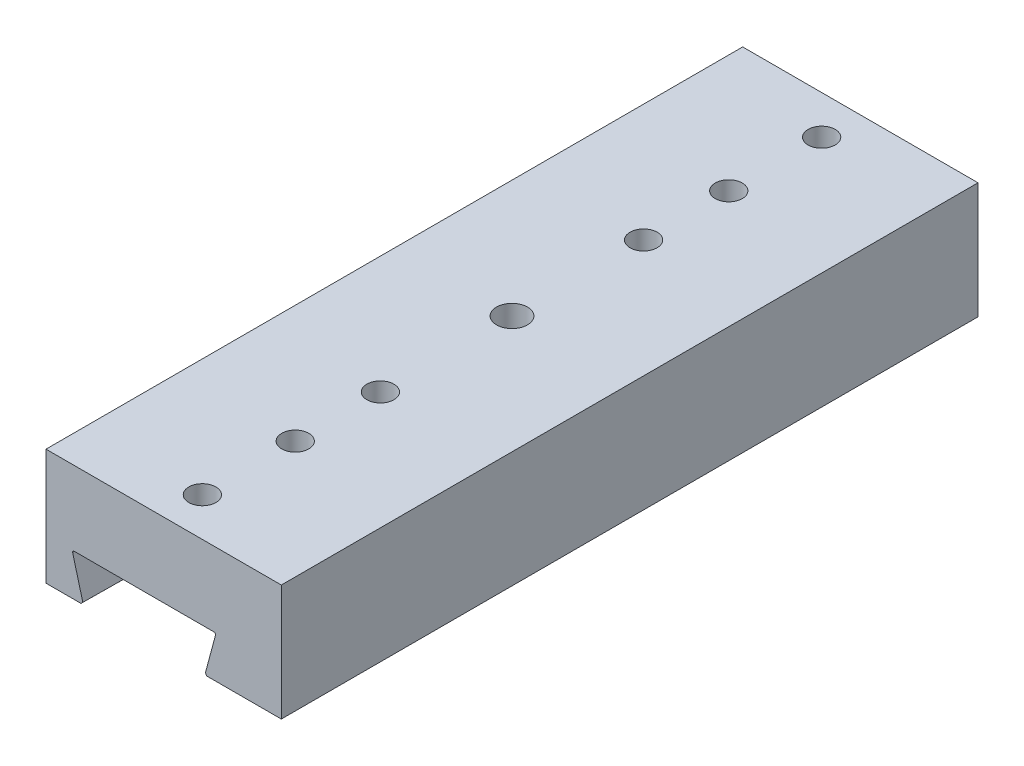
from build123d import *
from OCP.BRepFilletAPI import BRepFilletAPI_MakeChamfer

# Parameters (mm, degrees)
ESQUISSE1_W                                        = 152
ESQUISSE1_H                                        = 75
BOSS_EXTRU_1_DEPTH                                 = 225
CHAMBRAGE_POUR_VIS_T_TE_HEXAGONALE_M16_D           = 17.5
CHAMBRAGE_POUR_VIS_T_TE_HEXAGONALE_M16_CBORE_D     = 30
CHAMBRAGE_POUR_VIS_T_TE_HEXAGONALE_M16_CBORE_DEPTH = 20.6
ENL_V_MAT_EXTRU_1_REACH                            = 244.291
ESQUISSE6_R                                        = 10
CONG_1_R                                           = 1
CHANFREIN1_SIZE                                    = 1.5
CHANFREIN1_SIZE2                                   = 1.22475371
CHANFREIN1_SIZE2_2                                 = 1.224744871
CHANFREIN2_SIZE                                    = 1


with BuildPart() as part:
    # Esquisse1 → Boss.-Extru.1 (new, symmetric)
    with BuildSketch(Plane.XY):
        with Locations((0, -37.5)):
            Rectangle(ESQUISSE1_W, ESQUISSE1_H)
    extrude(amount=BOSS_EXTRU_1_DEPTH, both=True)

    # Esquisse3 → Enl_vement de mati_re-Lissage1 section 0
    with BuildSketch(Plane.XY.offset(225)):
        with BuildLine():
            Line((-51.9, -75), (26.6, -75))
            Line((26.6, -75), (33.834628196, -48))
            Line((33.834628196, -48), (-59.134628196, -48))
            Line((-59.134628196, -48), (-51.9, -75))
        make_face()
    # Esquisse2 → Enl_vement de mati_re-Lissage1 section 1
    with BuildSketch(Plane(origin=(0, 0, -225), x_dir=(-1, 0, 0), z_dir=(0, 0, -1))):
        with BuildLine():
            Line((47.4, -75), (-26.6, -75))
            Line((-26.6, -75), (-33.834628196, -48))
            Line((-33.834628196, -48), (54.634628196, -48))
            Line((54.634628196, -48), (47.4, -75))
        make_face()
    loft(mode=Mode.SUBTRACT)

    # Chambrage pour vis _ t_te hexagonale M16 (through all)
    with Locations(Plane(origin=(0, -48, 0), x_dir=(-1, 0, 0), z_dir=(0, -1, 0))):
        with Locations((0, -85), (0, -140), (0, -200), (0, 200), (0, 140), (0, 85)):
            CounterBoreHole(CHAMBRAGE_POUR_VIS_T_TE_HEXAGONALE_M16_D / 2, CHAMBRAGE_POUR_VIS_T_TE_HEXAGONALE_M16_CBORE_D / 2, CHAMBRAGE_POUR_VIS_T_TE_HEXAGONALE_M16_CBORE_DEPTH)

    # Esquisse6 → Enl_v. mat.-Extru.1 (cut, up to next)
    with BuildSketch(Plane.XZ.offset(48), mode=Mode.PRIVATE) as enl_v_mat_extru_1_sk1:
        with Locations(Location((0, 0, 0), (0, 0, 270))):
            Circle(ESQUISSE6_R)
    enl_v_mat_extru_1_tool1 = extrude(enl_v_mat_extru_1_sk1.sketch, amount=-ENL_V_MAT_EXTRU_1_REACH, mode=Mode.PRIVATE) & part.part
    add(enl_v_mat_extru_1_tool1.solids().sort_by_distance((0, -48, 0))[0], mode=Mode.SUBTRACT)

    # Cong_1
    cong_1_edges = [part.edges().sort_by_distance(p)[0] for p in [
        (33.834628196, -48, 0),
        (-56.884628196, -48, 0),
    ]]
    fillet(cong_1_edges, radius=CONG_1_R)

    # Chanfrein1: one chamfer whose edges measure the first distance from different faces: ONE call of the kernel's chamfer builder (chamfer() names one face for all edges)
    chanfrein1_edges_1 = [part.edges().sort_by_distance(p)[0] for p in [
        (-49.65, -75, 0),
    ]]
    chanfrein1_side_1 = [part.faces().sort_by_distance(p)[0] for p in [
        (-62.792979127, -75, -6.404174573),
    ]]
    chanfrein1_edges_2 = [part.edges().sort_by_distance(p)[0] for p in [
        (26.6, -75, 0),
    ]]
    chanfrein1_side_2 = [part.faces().sort_by_distance(p)[0] for p in [
        (30.048664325, -62.129409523, 0),
    ]]
    chanfrein1 = BRepFilletAPI_MakeChamfer(part.part.solid().wrapped)
    for e in chanfrein1_edges_1:
        chanfrein1.Add(CHANFREIN1_SIZE, CHANFREIN1_SIZE2, e.wrapped, chanfrein1_side_1[0].wrapped)  # the first distance lies on this face
    for e in chanfrein1_edges_2:
        chanfrein1.Add(CHANFREIN1_SIZE, CHANFREIN1_SIZE2_2, e.wrapped, chanfrein1_side_2[0].wrapped)  # the first distance lies on this face
    add(Compound.cast(chanfrein1.Shape()), mode=Mode.REPLACE)

    # Chanfrein2
    chanfrein2_edges = [part.edges().sort_by_distance(p)[0] for p in [
        (0, -48, 10),
    ]]
    chamfer(chanfrein2_edges, length=CHANFREIN2_SIZE)


solid = part.part
